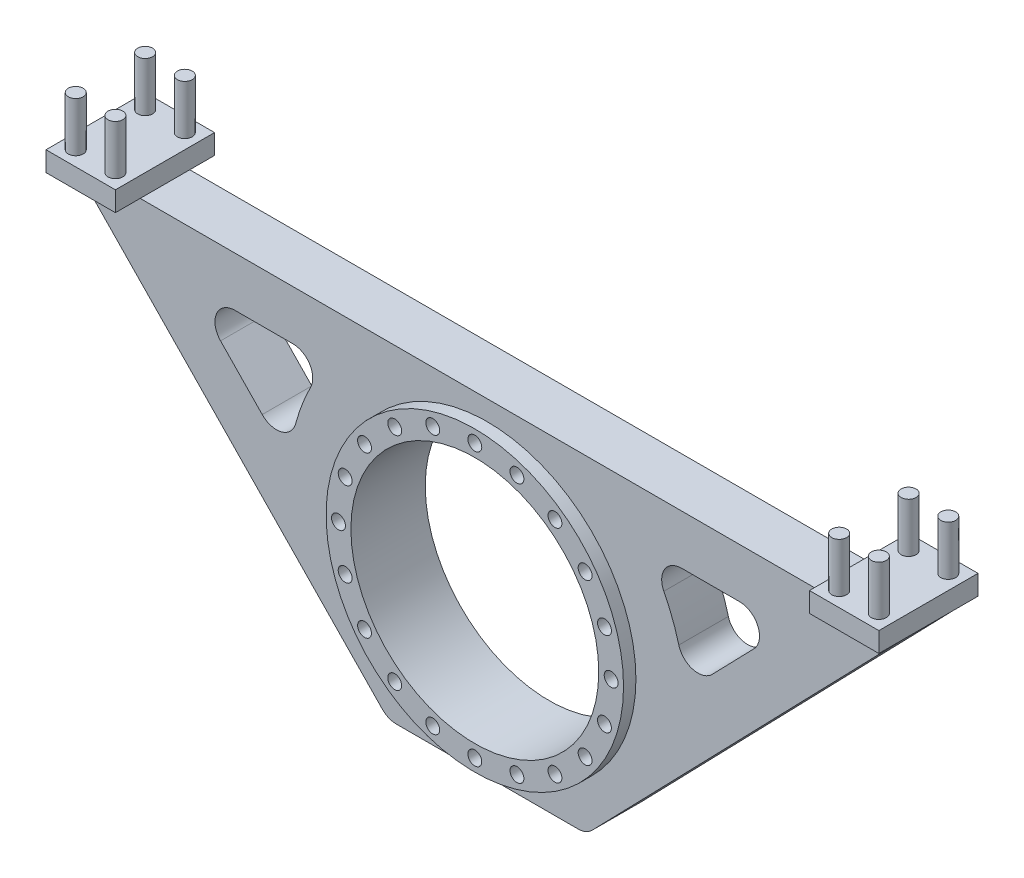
from build123d import *

# Parameters (mm, degrees)
SKETCH1_R           = 150
BOSS_EXTRUDE1_DEPTH = 25
SKETCH1_3_W         = 70
SKETCH1_3_H         = 20
BOSS_EXTRUDE2_DEPTH = 50
SKETCH1_4_R         = 150
SKETCH1_4_R_2       = 125
SKETCH1_4_R_3       = 7
BOSS_EXTRUDE3_DEPTH = 37.5
BOSS_EXTRUDE4_DEPTH = 50
FILLET1_R           = 20


with BuildPart() as part:
    # Sketch1 → Boss-Extrude1 (new, symmetric)
    with BuildSketch(Plane.XY):
        Polygon((100, -160), (-100, -160), (-420, 170), (-350, 170), (0, 170), (350, 170), (420, 170), align=None)
        Circle(SKETCH1_R, mode=Mode.SUBTRACT)
        with BuildLine():
            ThreePointArc((178.144708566, 90.909090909), (186.742276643, 71.605321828), (193.25508346, 51.502162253))
            ThreePointArc((193.25508346, 51.502162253), (207.539849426, 37.298027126), (226.938599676, 42.729461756))
            Line((226.938599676, 42.729461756), (268.972656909, 86.077083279))
            ThreePointArc((268.972656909, 86.077083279), (273.032823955, 107.795564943), (254.61464904, 120))
            Line((254.61464904, 120), (195.959179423, 120))
            ThreePointArc((195.959179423, 120), (178.903122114, 110.444659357), (178.144708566, 90.909090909))
        make_face(mode=Mode.SUBTRACT)
        with BuildLine():
            ThreePointArc((-178.144708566, 90.909090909), (-178.903122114, 110.444659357), (-195.959179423, 120))
            Line((-195.959179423, 120), (-254.61464904, 120))
            ThreePointArc((-254.61464904, 120), (-273.032823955, 107.795564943), (-268.972656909, 86.077083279))
            Line((-268.972656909, 86.077083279), (-226.938599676, 42.729461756))
            ThreePointArc((-226.938599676, 42.729461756), (-207.539849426, 37.298027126), (-193.25508346, 51.502162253))
            ThreePointArc((-193.25508346, 51.502162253), (-186.742276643, 71.605321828), (-178.144708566, 90.909090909))
        make_face(mode=Mode.SUBTRACT)
    extrude(amount=BOSS_EXTRUDE1_DEPTH, both=True)

    # Sketch1_3 → Boss-Extrude2 (add, symmetric)
    with BuildSketch(Plane.XY):
        with Locations((-385, 180)):
            Rectangle(SKETCH1_3_W, SKETCH1_3_H)
        with Locations((385, 180)):
            Rectangle(SKETCH1_3_W, SKETCH1_3_H)
    extrude(amount=BOSS_EXTRUDE2_DEPTH, both=True)

    # Sketch1_4 → Boss-Extrude3 (add, symmetric)
    with BuildSketch(Plane.XY):
        Circle(SKETCH1_4_R)
        Circle(SKETCH1_4_R_2, mode=Mode.SUBTRACT)
        with Locations((0, 137.5)):
            Circle(SKETCH1_4_R_3, mode=Mode.SUBTRACT)
        with Locations((42.489836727, 130.770270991)):
            Circle(SKETCH1_4_R_3, mode=Mode.SUBTRACT)
        with Locations((80.82047219, 111.239836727)):
            Circle(SKETCH1_4_R_3, mode=Mode.SUBTRACT)
        with Locations((111.239836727, 80.82047219)):
            Circle(SKETCH1_4_R_3, mode=Mode.SUBTRACT)
        with Locations((130.770270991, 42.489836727)):
            Circle(SKETCH1_4_R_3, mode=Mode.SUBTRACT)
        with Locations((137.5, 0)):
            Circle(SKETCH1_4_R_3, mode=Mode.SUBTRACT)
        with Locations((130.770270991, -42.489836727)):
            Circle(SKETCH1_4_R_3, mode=Mode.SUBTRACT)
        with Locations((111.239836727, -80.82047219)):
            Circle(SKETCH1_4_R_3, mode=Mode.SUBTRACT)
        with Locations((80.82047219, -111.239836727)):
            Circle(SKETCH1_4_R_3, mode=Mode.SUBTRACT)
        with Locations((42.489836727, -130.770270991)):
            Circle(SKETCH1_4_R_3, mode=Mode.SUBTRACT)
        with Locations((0, -137.5)):
            Circle(SKETCH1_4_R_3, mode=Mode.SUBTRACT)
        with Locations((-42.489836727, -130.770270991)):
            Circle(SKETCH1_4_R_3, mode=Mode.SUBTRACT)
        with Locations((-80.82047219, -111.239836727)):
            Circle(SKETCH1_4_R_3, mode=Mode.SUBTRACT)
        with Locations((-111.239836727, -80.82047219)):
            Circle(SKETCH1_4_R_3, mode=Mode.SUBTRACT)
        with Locations((-130.770270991, -42.489836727)):
            Circle(SKETCH1_4_R_3, mode=Mode.SUBTRACT)
        with Locations((-137.5, 0)):
            Circle(SKETCH1_4_R_3, mode=Mode.SUBTRACT)
        with Locations((-130.770270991, 42.489836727)):
            Circle(SKETCH1_4_R_3, mode=Mode.SUBTRACT)
        with Locations((-111.239836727, 80.82047219)):
            Circle(SKETCH1_4_R_3, mode=Mode.SUBTRACT)
        with Locations((-80.82047219, 111.239836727)):
            Circle(SKETCH1_4_R_3, mode=Mode.SUBTRACT)
        with Locations((-42.489836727, 130.770270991)):
            Circle(SKETCH1_4_R_3, mode=Mode.SUBTRACT)
    extrude(amount=BOSS_EXTRUDE3_DEPTH, both=True)

    # Sketch2 → Boss-Extrude4 (add)
    with BuildSketch(Plane(origin=(0, 190, 0), x_dir=(1, 0, 0), z_dir=(0, 1, 0))):
        with BuildLine():
            ThreePointArc((-397.5, 35), (-410.303300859, 40.303300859), (-405, 27.5))
            Line((-405, 27.5), (-405, 35))
            Line((-405, 35), (-397.5, 35))
        make_face()
        with BuildLine():
            Line((-405, 35), (-405, 27.5))
            ThreePointArc((-405, 27.5), (-399.696699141, 29.696699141), (-397.5, 35))
            Line((-397.5, 35), (-405, 35))
        make_face()
        with BuildLine():
            ThreePointArc((-397.5, 35), (-410.303300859, 40.303300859), (-405, 27.5))
            Line((-405, 27.5), (-405, 35))
            Line((-405, 35), (-397.5, 35))
        make_face()
        with BuildLine():
            Line((-405, 35), (-405, 27.5))
            ThreePointArc((-405, 27.5), (-399.696699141, 29.696699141), (-397.5, 35))
            Line((-397.5, 35), (-405, 35))
        make_face()
        with BuildLine():
            ThreePointArc((-372.5, 35), (-370.303300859, 29.696699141), (-365, 27.5))
            Line((-365, 27.5), (-365, 35))
            Line((-365, 35), (-372.5, 35))
        make_face()
        with BuildLine():
            Line((-365, 35), (-365, 27.5))
            ThreePointArc((-365, 27.5), (-359.696699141, 29.696699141), (-357.5, 35))
            ThreePointArc((-357.5, 35), (-365, 42.5), (-372.5, 35))
            Line((-372.5, 35), (-365, 35))
        make_face()
        with BuildLine():
            ThreePointArc((-372.5, 35), (-370.303300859, 29.696699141), (-365, 27.5))
            Line((-365, 27.5), (-365, 35))
            Line((-365, 35), (-372.5, 35))
        make_face()
        with BuildLine():
            Line((-365, 35), (-365, 27.5))
            ThreePointArc((-365, 27.5), (-359.696699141, 29.696699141), (-357.5, 35))
            ThreePointArc((-357.5, 35), (-365, 42.5), (-372.5, 35))
            Line((-372.5, 35), (-365, 35))
        make_face()
        with BuildLine():
            ThreePointArc((-357.5, -35), (-359.696699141, -29.696699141), (-365, -27.5))
            Line((-365, -27.5), (-365, -35))
            Line((-365, -35), (-372.5, -35))
            ThreePointArc((-372.5, -35), (-365, -42.5), (-357.5, -35))
        make_face()
        with BuildLine():
            Line((-365, -35), (-365, -27.5))
            ThreePointArc((-365, -27.5), (-370.303300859, -29.696699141), (-372.5, -35))
            Line((-372.5, -35), (-365, -35))
        make_face()
        with BuildLine():
            ThreePointArc((-357.5, -35), (-359.696699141, -29.696699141), (-365, -27.5))
            Line((-365, -27.5), (-365, -35))
            Line((-365, -35), (-372.5, -35))
            ThreePointArc((-372.5, -35), (-365, -42.5), (-357.5, -35))
        make_face()
        with BuildLine():
            Line((-365, -35), (-365, -27.5))
            ThreePointArc((-365, -27.5), (-370.303300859, -29.696699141), (-372.5, -35))
            Line((-372.5, -35), (-365, -35))
        make_face()
        with BuildLine():
            ThreePointArc((-397.5, -35), (-399.696699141, -29.696699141), (-405, -27.5))
            Line((-405, -27.5), (-405, -35))
            Line((-405, -35), (-397.5, -35))
        make_face()
        with BuildLine():
            Line((-405, -35), (-405, -27.5))
            ThreePointArc((-405, -27.5), (-410.303300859, -40.303300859), (-397.5, -35))
            Line((-397.5, -35), (-405, -35))
        make_face()
        with BuildLine():
            ThreePointArc((-397.5, -35), (-399.696699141, -29.696699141), (-405, -27.5))
            Line((-405, -27.5), (-405, -35))
            Line((-405, -35), (-397.5, -35))
        make_face()
        with BuildLine():
            Line((-405, -35), (-405, -27.5))
            ThreePointArc((-405, -27.5), (-410.303300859, -40.303300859), (-397.5, -35))
            Line((-397.5, -35), (-405, -35))
        make_face()
    boss_extrude4 = extrude(amount=BOSS_EXTRUDE4_DEPTH)

    # Mirror1: Boss-Extrude4 across plane
    add(boss_extrude4.mirror(Plane(origin=(0, 0, 0), x_dir=(0, 0, 1), z_dir=(1, 0, 0))))

    # Fillet1
    fillet1_edges = [part.edges().sort_by_distance(p)[0] for p in [
        (-100, -160, 0),
        (100, -160, 0),
    ]]
    fillet(fillet1_edges, radius=FILLET1_R)


solid = part.part
